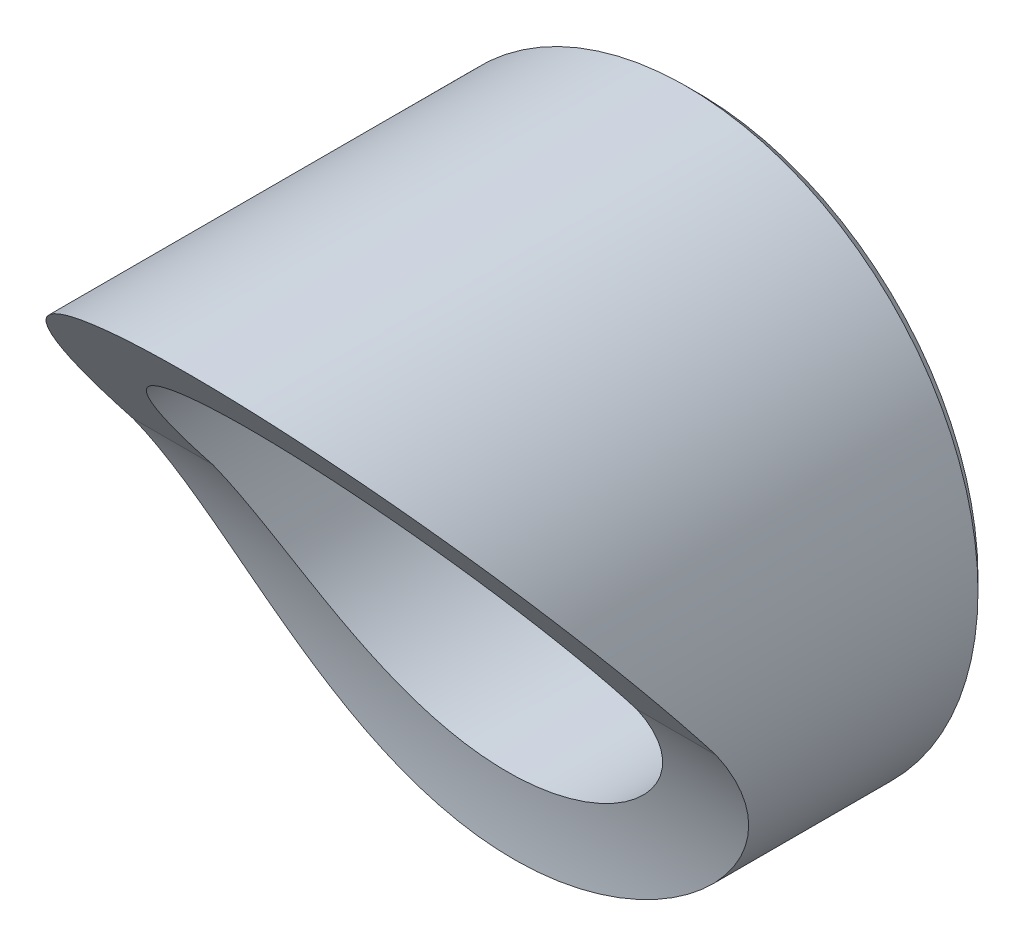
ISO-10303-21;
HEADER;
FILE_DESCRIPTION(('STEP AP214'),'2;1');
FILE_NAME('part.step','',(''),(''),'','','');
FILE_SCHEMA(('AUTOMOTIVE_DESIGN { 1 0 10303 214 1 1 1 1 }'));
ENDSEC;
DATA;
#1=APPLICATION_CONTEXT('core data for automotive mechanical design processes');
#2=APPLICATION_PROTOCOL_DEFINITION('international standard','automotive_design',2000,#1);
#3=PRODUCT_CONTEXT('',#1,'mechanical');
#4=PRODUCT('Part','Part','',(#3));
#5=PRODUCT_RELATED_PRODUCT_CATEGORY('part','',(#4));
#6=PRODUCT_DEFINITION_FORMATION('','',#4);
#7=PRODUCT_DEFINITION_CONTEXT('part definition',#1,'design');
#8=PRODUCT_DEFINITION('design','',#6,#7);
#9=PRODUCT_DEFINITION_SHAPE('','',#8);
#10=(LENGTH_UNIT() NAMED_UNIT(*) SI_UNIT(.MILLI.,.METRE.));
#11=(NAMED_UNIT(*) PLANE_ANGLE_UNIT() SI_UNIT($,.RADIAN.));
#12=(NAMED_UNIT(*) SI_UNIT($,.STERADIAN.) SOLID_ANGLE_UNIT());
#13=UNCERTAINTY_MEASURE_WITH_UNIT(LENGTH_MEASURE(1.E-05),#10,'distance_accuracy_value','');
#14=(GEOMETRIC_REPRESENTATION_CONTEXT(3) GLOBAL_UNCERTAINTY_ASSIGNED_CONTEXT((#13)) GLOBAL_UNIT_ASSIGNED_CONTEXT((#10,
#11,#12)) REPRESENTATION_CONTEXT('',''));
#15=CARTESIAN_POINT('',(0.,0.,0.));
#16=DIRECTION('',(0.,0.,1.));
#17=DIRECTION('',(1.,0.,0.));
#18=AXIS2_PLACEMENT_3D('',#15,#16,#17);
#19=CARTESIAN_POINT('',(0.,0.,0.));
#20=DIRECTION('',(0.,0.,1.));
#21=DIRECTION('',(1.,0.,0.));
#22=AXIS2_PLACEMENT_3D('',#19,#20,#21);
#23=PLANE('',#22);
#24=CARTESIAN_POINT('',(0.,0.,0.));
#25=DIRECTION('',(0.,0.,1.));
#26=DIRECTION('',(1.,0.,0.));
#27=AXIS2_PLACEMENT_3D('',#24,#25,#26);
#28=CIRCLE('',#27,11.5);
#29=CARTESIAN_POINT('',(11.5,0.,0.));
#30=VERTEX_POINT('',#29);
#31=EDGE_CURVE('E58',#30,#30,#28,.F.);
#32=ORIENTED_EDGE('',*,*,#31,.T.);
#33=EDGE_LOOP('',(#32));
#34=FACE_BOUND('',#33,.T.);
#35=CARTESIAN_POINT('',(0.,0.,0.));
#36=DIRECTION('',(0.,0.,-1.));
#37=DIRECTION('',(-1.,0.,0.));
#38=AXIS2_PLACEMENT_3D('',#35,#36,#37);
#39=CIRCLE('',#38,10.025);
#40=CARTESIAN_POINT('',(-10.025,0.,0.));
#41=VERTEX_POINT('',#40);
#42=EDGE_CURVE('E123',#41,#41,#39,.T.);
#43=ORIENTED_EDGE('',*,*,#42,.F.);
#44=EDGE_LOOP('',(#43));
#45=FACE_BOUND('',#44,.T.);
#46=ADVANCED_FACE('F49',(#34,#45),#23,.F.);
#47=CARTESIAN_POINT('',(0.,0.,21.));
#48=DIRECTION('',(0.,0.,-1.));
#49=DIRECTION('',(-1.,0.,0.));
#50=AXIS2_PLACEMENT_3D('',#47,#48,#49);
#51=CYLINDRICAL_SURFACE('',#50,12.);
#52=CARTESIAN_POINT('',(0.,0.,0.500000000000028));
#53=DIRECTION('',(0.,0.,1.));
#54=DIRECTION('',(1.,0.,0.));
#55=AXIS2_PLACEMENT_3D('',#52,#53,#54);
#56=CIRCLE('',#55,12.);
#57=CARTESIAN_POINT('',(12.,0.,0.500000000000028));
#58=VERTEX_POINT('',#57);
#59=EDGE_CURVE('E103',#58,#58,#56,.T.);
#60=ORIENTED_EDGE('',*,*,#59,.T.);
#61=EDGE_LOOP('',(#60));
#62=FACE_BOUND('',#61,.T.);
#63=CARTESIAN_POINT('',(11.9911472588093,-0.460855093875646,11.2645130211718));
#64=CARTESIAN_POINT('',(11.9860302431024,-0.593990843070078,11.1704663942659));
#65=CARTESIAN_POINT('',(11.9786509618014,-0.728210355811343,11.0780976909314));
#66=CARTESIAN_POINT('',(11.9591432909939,-0.998638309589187,10.8968104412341));
#67=CARTESIAN_POINT('',(11.9470144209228,-1.13484695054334,10.8078922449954));
#68=CARTESIAN_POINT('',(11.9031548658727,-1.54627760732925,10.5464004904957));
#69=CARTESIAN_POINT('',(11.8639556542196,-1.82417795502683,10.3791789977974));
#70=CARTESIAN_POINT('',(11.764007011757,-2.38526149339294,10.0597261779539));
#71=CARTESIAN_POINT('',(11.7032242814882,-2.66845220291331,9.90751848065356));
#72=CARTESIAN_POINT('',(11.5588575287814,-3.23710026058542,9.61908851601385));
#73=CARTESIAN_POINT('',(11.475279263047,-3.5225570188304,9.4828622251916));
#74=CARTESIAN_POINT('',(11.2839824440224,-4.09426702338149,9.22615878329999));
#75=CARTESIAN_POINT('',(11.1761511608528,-4.38051761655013,9.10575947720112));
#76=CARTESIAN_POINT('',(10.9361525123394,-4.94932837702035,8.88151982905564));
#77=CARTESIAN_POINT('',(10.8039830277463,-5.23188822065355,8.77768093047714));
#78=CARTESIAN_POINT('',(10.5156778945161,-5.78954809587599,8.58639850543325));
#79=CARTESIAN_POINT('',(10.3595858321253,-6.0646606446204,8.49892579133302));
#80=CARTESIAN_POINT('',(10.0238657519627,-6.6047869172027,8.33939304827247));
#81=CARTESIAN_POINT('',(9.84423929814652,-6.86980131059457,8.26733199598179));
#82=CARTESIAN_POINT('',(9.47512586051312,-7.36967121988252,8.1417875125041));
#83=CARTESIAN_POINT('',(9.28707712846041,-7.60536209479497,8.08739050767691));
#84=CARTESIAN_POINT('',(8.89248641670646,-8.06318823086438,7.98989299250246));
#85=CARTESIAN_POINT('',(8.6859452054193,-8.28532405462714,7.94679201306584));
#86=CARTESIAN_POINT('',(8.25551181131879,-8.7142945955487,7.87053843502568));
#87=CARTESIAN_POINT('',(8.03160557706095,-8.92111665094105,7.83739400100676));
#88=CARTESIAN_POINT('',(7.56804898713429,-9.31759979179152,7.77968529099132));
#89=CARTESIAN_POINT('',(7.32839807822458,-9.50726027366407,7.75512131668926));
#90=CARTESIAN_POINT('',(6.82854744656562,-9.87265085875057,7.71258952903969));
#91=CARTESIAN_POINT('',(6.56797722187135,-10.0478957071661,7.6948081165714));
#92=CARTESIAN_POINT('',(6.03365908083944,-10.3775482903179,7.66523016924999));
#93=CARTESIAN_POINT('',(5.75991104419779,-10.5319558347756,7.65343368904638));
#94=CARTESIAN_POINT('',(5.20103692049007,-10.8188666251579,7.63438949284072));
#95=CARTESIAN_POINT('',(4.91591138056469,-10.9513709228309,7.6271415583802));
#96=CARTESIAN_POINT('',(4.33608605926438,-11.193618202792,7.61589491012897));
#97=CARTESIAN_POINT('',(4.04138598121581,-11.3033604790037,7.61189629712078));
#98=CARTESIAN_POINT('',(3.42785389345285,-11.5047686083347,7.60586421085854));
#99=CARTESIAN_POINT('',(3.10858539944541,-11.5951108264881,7.60395071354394));
#100=CARTESIAN_POINT('',(2.46365509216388,-11.749056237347,7.60142610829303));
#101=CARTESIAN_POINT('',(2.13799306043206,-11.8126585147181,7.60081504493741));
#102=CARTESIAN_POINT('',(1.48247275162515,-11.9126913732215,7.60012787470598));
#103=CARTESIAN_POINT('',(1.15261388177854,-11.9491180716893,7.600051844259));
#104=CARTESIAN_POINT('',(0.491014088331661,-11.9945342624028,7.59998784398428));
#105=CARTESIAN_POINT('',(0.159273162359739,-12.0035237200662,7.59999987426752));
#106=CARTESIAN_POINT('',(-0.509419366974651,-11.9939225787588,7.60000020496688));
#107=CARTESIAN_POINT('',(-0.846364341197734,-11.9748635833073,7.59998810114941));
#108=CARTESIAN_POINT('',(-1.51745702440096,-11.908443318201,7.60018211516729));
#109=CARTESIAN_POINT('',(-1.85160468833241,-11.8610815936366,7.60038823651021));
#110=CARTESIAN_POINT('',(-2.5147495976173,-11.738387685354,7.60161712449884));
#111=CARTESIAN_POINT('',(-2.84374646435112,-11.663053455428,7.60263995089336));
#112=CARTESIAN_POINT('',(-3.49421986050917,-11.4849525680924,7.606434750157));
#113=CARTESIAN_POINT('',(-3.81569640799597,-11.3821859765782,7.60920671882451));
#114=CARTESIAN_POINT('',(-4.4488979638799,-11.1499350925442,7.61773571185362));
#115=CARTESIAN_POINT('',(-4.76062066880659,-11.0204445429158,7.62349343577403));
#116=CARTESIAN_POINT('',(-5.37196826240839,-10.7357187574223,7.63949119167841));
#117=CARTESIAN_POINT('',(-5.67159307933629,-10.5804833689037,7.64973125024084));
#118=CARTESIAN_POINT('',(-6.256541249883,-10.2454526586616,7.67640114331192));
#119=CARTESIAN_POINT('',(-6.54186325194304,-10.0656550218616,7.69283156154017));
#120=CARTESIAN_POINT('',(-7.09598995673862,-9.68298948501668,7.73373538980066));
#121=CARTESIAN_POINT('',(-7.36479507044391,-9.48012215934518,7.75820859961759));
#122=CARTESIAN_POINT('',(-7.87882549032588,-9.05719354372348,7.81655830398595));
#123=CARTESIAN_POINT('',(-8.12440311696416,-8.83753468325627,7.85024626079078));
#124=CARTESIAN_POINT('',(-8.59576842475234,-8.37977822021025,7.92900849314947));
#125=CARTESIAN_POINT('',(-8.82155633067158,-8.14168082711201,7.97408263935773));
#126=CARTESIAN_POINT('',(-9.25141975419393,-7.64969452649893,8.07724584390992));
#127=CARTESIAN_POINT('',(-9.45551773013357,-7.39582239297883,8.13532124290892));
#128=CARTESIAN_POINT('',(-9.84083547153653,-6.87480314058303,8.26597681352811));
#129=CARTESIAN_POINT('',(-10.0220567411,-6.60765689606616,8.33855603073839));
#130=CARTESIAN_POINT('',(-10.3507430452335,-6.07892546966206,8.49470248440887));
#131=CARTESIAN_POINT('',(-10.4995564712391,-5.81791674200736,8.57738801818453));
#132=CARTESIAN_POINT('',(-10.7754356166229,-5.28950022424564,8.75730724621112));
#133=CARTESIAN_POINT('',(-10.902501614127,-5.02209251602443,8.85454075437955));
#134=CARTESIAN_POINT('',(-11.1348974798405,-4.48332916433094,9.06400005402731));
#135=CARTESIAN_POINT('',(-11.2402019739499,-4.21196930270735,9.17624309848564));
#136=CARTESIAN_POINT('',(-11.4291791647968,-3.66833264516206,9.41562481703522));
#137=CARTESIAN_POINT('',(-11.5128541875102,-3.39605595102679,9.54276188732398));
#138=CARTESIAN_POINT('',(-11.647545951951,-2.89662876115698,9.7900759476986));
#139=CARTESIAN_POINT('',(-11.7016469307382,-2.66923547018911,9.90810613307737));
#140=CARTESIAN_POINT('',(-11.7957002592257,-2.21693634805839,10.1541424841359));
#141=CARTESIAN_POINT('',(-11.8356526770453,-1.99203050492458,10.282148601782));
#142=CARTESIAN_POINT('',(-11.9020460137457,-1.54656544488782,10.5473561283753));
#143=CARTESIAN_POINT('',(-11.9285244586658,-1.32599581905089,10.6845307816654));
#144=CARTESIAN_POINT('',(-11.9689869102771,-0.88961930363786,10.9678824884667));
#145=CARTESIAN_POINT('',(-11.9829742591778,-0.673811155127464,11.1140571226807));
#146=CARTESIAN_POINT('',(-11.9911472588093,-0.46085509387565,11.2645130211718));
#147=B_SPLINE_CURVE_WITH_KNOTS('',3,(#63,#64,#65,#66,#67,#68,#69,#70,#71,#72,#73,#74,#75,#76,
#77,#78,#79,#80,#81,#82,#83,#84,#85,#86,#87,#88,#89,#90,#91,#92,#93,#94,#95,#96,#97,#98,#99,
#100,#101,#102,#103,#104,#105,#106,#107,#108,#109,#110,#111,#112,#113,#114,#115,#116,#117,#118,
#119,#120,#121,#122,#123,#124,#125,#126,#127,#128,#129,#130,#131,#132,#133,#134,#135,#136,#137,
#138,#139,#140,#141,#142,#143,#144,#145,#146),.UNSPECIFIED.,.F.,.F.,(4,2,2,2,2,2,2,2,2,2,2,2,2,
2,2,2,2,2,2,2,2,2,2,2,2,2,2,2,2,2,2,2,2,2,2,2,2,2,2,2,2,4),(0.,0.489193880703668,
0.978437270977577,1.95738716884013,2.93785401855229,3.91807349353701,4.90294688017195,
5.88790606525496,6.87109156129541,7.85421175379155,8.77229959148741,9.69034929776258,
10.6091497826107,11.5279825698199,12.4705059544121,13.4130379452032,14.355524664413,
15.2980406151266,16.2923155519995,17.2866245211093,18.2810755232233,19.2755277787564,
20.2867765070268,21.2980414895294,22.3093804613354,23.3207170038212,24.3322906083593,
25.3438702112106,26.3555452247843,27.3671950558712,28.3595216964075,29.3518370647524,
30.3431147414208,31.3343272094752,32.2680370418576,33.2017349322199,34.1365154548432,
35.0711954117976,35.8561684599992,36.6411377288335,37.4239086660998,38.2064700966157),.UNSPECIFIED.);
#148=CARTESIAN_POINT('',(11.9911472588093,-0.460855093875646,11.2645130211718));
#149=VERTEX_POINT('',#148);
#150=CARTESIAN_POINT('',(-11.9911472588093,-0.460855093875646,11.2645130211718));
#151=VERTEX_POINT('',#150);
#152=EDGE_CURVE('E88',#149,#151,#147,.T.);
#153=ORIENTED_EDGE('',*,*,#152,.T.);
#154=CARTESIAN_POINT('',(0.,0.,11.6245724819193));
#155=DIRECTION('',(0.,0.615661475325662,-0.788010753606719));
#156=DIRECTION('',(0.,-0.788010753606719,-0.615661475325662));
#157=AXIS2_PLACEMENT_3D('',#154,#155,#156);
#158=ELLIPSE('',#157,15.228218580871,12.);
#159=EDGE_CURVE('E85',#151,#149,#158,.T.);
#160=ORIENTED_EDGE('',*,*,#159,.T.);
#161=EDGE_LOOP('',(#153,#160));
#162=FACE_BOUND('',#161,.T.);
#163=ADVANCED_FACE('F104',(#62,#162),#51,.T.);
#164=CARTESIAN_POINT('',(-50.,-12.,27.6));
#165=DIRECTION('',(1.,0.,0.));
#166=DIRECTION('',(0.,0.,-1.));
#167=AXIS2_PLACEMENT_3D('',#164,#165,#166);
#168=CYLINDRICAL_SURFACE('',#167,20.);
#169=DIRECTION('',(1.,0.,0.));
#170=VECTOR('',#169,1.);
#171=CARTESIAN_POINT('',(-50.,-0.460855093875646,11.2645130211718));
#172=LINE('',#171,#170);
#173=CARTESIAN_POINT('',(8.73785514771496,-0.460855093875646,11.2645130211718));
#174=VERTEX_POINT('',#173);
#175=EDGE_CURVE('E80',#174,#149,#172,.T.);
#176=ORIENTED_EDGE('',*,*,#175,.F.);
#177=CARTESIAN_POINT('',(8.73785514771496,-0.460855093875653,11.2645130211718));
#178=CARTESIAN_POINT('',(8.72650180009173,-0.676511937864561,11.1121253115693));
#179=CARTESIAN_POINT('',(8.70694901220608,-0.8950177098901,10.9642283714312));
#180=CARTESIAN_POINT('',(8.65022569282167,-1.33623443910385,10.6780360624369));
#181=CARTESIAN_POINT('',(8.61304082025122,-1.55894867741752,10.5397486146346));
#182=CARTESIAN_POINT('',(8.51968657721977,-2.00751351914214,10.2731820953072));
#183=CARTESIAN_POINT('',(8.46345145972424,-2.23337235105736,10.1449396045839));
#184=CARTESIAN_POINT('',(8.33109472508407,-2.68528788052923,9.89965579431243));
#185=CARTESIAN_POINT('',(8.25497851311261,-2.91134450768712,9.782611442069));
#186=CARTESIAN_POINT('',(8.08173165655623,-3.36256196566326,9.55953571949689));
#187=CARTESIAN_POINT('',(7.98448937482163,-3.58771130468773,9.45356746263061));
#188=CARTESIAN_POINT('',(7.76895304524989,-4.03325004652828,9.25359635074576));
#189=CARTESIAN_POINT('',(7.6506569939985,-4.25363899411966,9.15959463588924));
#190=CARTESIAN_POINT('',(7.39349341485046,-4.68635758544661,8.98374203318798));
#191=CARTESIAN_POINT('',(7.25467562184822,-4.89870519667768,8.90186270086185));
#192=CARTESIAN_POINT('',(6.95687453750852,-5.31314292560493,8.74967704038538));
#193=CARTESIAN_POINT('',(6.7978934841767,-5.5152341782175,8.67936942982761));
#194=CARTESIAN_POINT('',(6.47703352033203,-5.88770083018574,8.55598463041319));
#195=CARTESIAN_POINT('',(6.31690736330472,-6.05925647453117,8.50190023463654));
#196=CARTESIAN_POINT('',(5.98203287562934,-6.39008362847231,8.40211752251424));
#197=CARTESIAN_POINT('',(5.80728544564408,-6.54935589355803,8.35641869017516));
#198=CARTESIAN_POINT('',(5.44423972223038,-6.85412057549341,8.27268957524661));
#199=CARTESIAN_POINT('',(5.2559321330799,-6.99960337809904,8.23466462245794));
#200=CARTESIAN_POINT('',(4.8672235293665,-7.27525982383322,8.16557101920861));
#201=CARTESIAN_POINT('',(4.66682242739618,-7.40543335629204,8.13450241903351));
#202=CARTESIAN_POINT('',(4.25992992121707,-7.64658046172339,8.07917240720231));
#203=CARTESIAN_POINT('',(4.05366974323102,-7.75791365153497,8.05477618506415));
#204=CARTESIAN_POINT('',(3.63233875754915,-7.96389519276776,8.01120343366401));
#205=CARTESIAN_POINT('',(3.41726412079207,-8.05853619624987,7.99202920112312));
#206=CARTESIAN_POINT('',(2.97992773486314,-8.23029237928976,7.95828500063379));
#207=CARTESIAN_POINT('',(2.75766736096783,-8.30741089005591,7.9437141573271));
#208=CARTESIAN_POINT('',(2.30754574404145,-8.44351792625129,7.91863254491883));
#209=CARTESIAN_POINT('',(2.07968691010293,-8.50251410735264,7.90812006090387));
#210=CARTESIAN_POINT('',(1.61526975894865,-8.60296211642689,7.8905405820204));
#211=CARTESIAN_POINT('',(1.37862852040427,-8.6440435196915,7.88354591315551));
#212=CARTESIAN_POINT('',(0.902694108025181,-8.70662122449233,7.87299657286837));
#213=CARTESIAN_POINT('',(0.663400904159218,-8.72811730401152,7.86944194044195));
#214=CARTESIAN_POINT('',(0.183797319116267,-8.75136367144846,7.86560105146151));
#215=CARTESIAN_POINT('',(-0.0565131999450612,-8.75311119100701,7.86531525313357));
#216=CARTESIAN_POINT('',(-0.53644632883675,-8.73684018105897,7.86799921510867));
#217=CARTESIAN_POINT('',(-0.776068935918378,-8.71882157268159,7.87096898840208));
#218=CARTESIAN_POINT('',(-1.2554056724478,-8.66286755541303,7.88035598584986));
#219=CARTESIAN_POINT('',(-1.49509551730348,-8.62472970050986,7.88680826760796));
#220=CARTESIAN_POINT('',(-1.97035767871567,-8.52871409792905,7.9034890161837));
#221=CARTESIAN_POINT('',(-2.20592995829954,-8.47083617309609,7.91371751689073));
#222=CARTESIAN_POINT('',(-2.67125431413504,-8.33580161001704,7.93840401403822));
#223=CARTESIAN_POINT('',(-2.90100647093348,-8.25864523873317,7.95286195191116));
#224=CARTESIAN_POINT('',(-3.35301819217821,-8.0856863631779,7.98658862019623));
#225=CARTESIAN_POINT('',(-3.57527781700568,-7.98988400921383,8.00585731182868));
#226=CARTESIAN_POINT('',(-4.0096481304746,-7.78094030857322,8.04978590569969));
#227=CARTESIAN_POINT('',(-4.22180146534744,-7.66788224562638,8.07442014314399));
#228=CARTESIAN_POINT('',(-4.63550316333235,-7.42510137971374,8.1298742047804));
#229=CARTESIAN_POINT('',(-4.83705155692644,-7.29537862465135,8.16069401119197));
#230=CARTESIAN_POINT('',(-5.22802468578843,-7.02049509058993,8.22928539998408));
#231=CARTESIAN_POINT('',(-5.41745159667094,-6.87533709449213,8.2670557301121));
#232=CARTESIAN_POINT('',(-5.78284700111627,-6.57097508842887,8.35030991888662));
#233=CARTESIAN_POINT('',(-5.95881576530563,-6.41177136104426,8.39579362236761));
#234=CARTESIAN_POINT('',(-6.29287229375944,-6.08407433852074,8.49422797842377));
#235=CARTESIAN_POINT('',(-6.45123618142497,-5.91581489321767,8.54702041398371));
#236=CARTESIAN_POINT('',(-6.75287178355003,-5.56902436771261,8.66126007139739));
#237=CARTESIAN_POINT('',(-6.89614371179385,-5.39049343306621,8.72270717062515));
#238=CARTESIAN_POINT('',(-7.16681848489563,-5.02502836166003,8.85466729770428));
#239=CARTESIAN_POINT('',(-7.29422498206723,-4.83809617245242,8.92517823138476));
#240=CARTESIAN_POINT('',(-7.53271425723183,-4.45770249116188,9.07554135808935));
#241=CARTESIAN_POINT('',(-7.64379725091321,-4.26424108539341,9.15539342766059));
#242=CARTESIAN_POINT('',(-7.84907404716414,-3.87338384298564,9.32424358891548));
#243=CARTESIAN_POINT('',(-7.94332385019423,-3.67600357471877,9.41320974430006));
#244=CARTESIAN_POINT('',(-8.11545667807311,-3.27853220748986,9.60043717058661));
#245=CARTESIAN_POINT('',(-8.19333871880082,-3.07844094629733,9.69869899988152));
#246=CARTESIAN_POINT('',(-8.33306158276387,-2.67725997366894,9.90431305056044));
#247=CARTESIAN_POINT('',(-8.39489721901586,-2.47616996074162,10.0116681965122));
#248=CARTESIAN_POINT('',(-8.50301691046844,-2.07470886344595,10.2350531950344));
#249=CARTESIAN_POINT('',(-8.5493043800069,-1.87433763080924,10.3510811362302));
#250=CARTESIAN_POINT('',(-8.62831042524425,-1.46925209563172,10.5952655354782));
#251=CARTESIAN_POINT('',(-8.66054177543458,-1.26460689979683,10.7236928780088));
#252=CARTESIAN_POINT('',(-8.71007420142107,-0.859469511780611,10.9883396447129));
#253=CARTESIAN_POINT('',(-8.72742089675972,-0.658966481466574,11.1245338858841));
#254=CARTESIAN_POINT('',(-8.73785514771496,-0.460855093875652,11.2645130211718));
#255=B_SPLINE_CURVE_WITH_KNOTS('',3,(#177,#178,#179,#180,#181,#182,#183,#184,#185,#186,#187,
#188,#189,#190,#191,#192,#193,#194,#195,#196,#197,#198,#199,#200,#201,#202,#203,#204,#205,#206,
#207,#208,#209,#210,#211,#212,#213,#214,#215,#216,#217,#218,#219,#220,#221,#222,#223,#224,#225,
#226,#227,#228,#229,#230,#231,#232,#233,#234,#235,#236,#237,#238,#239,#240,#241,#242,#243,#244,
#245,#246,#247,#248,#249,#250,#251,#252,#253,#254),.UNSPECIFIED.,.F.,.F.,(4,2,2,2,2,2,2,2,2,2,2,
2,2,2,2,2,2,2,2,2,2,2,2,2,2,2,2,2,2,2,2,2,2,2,2,2,2,2,4),(0.,0.792876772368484,1.58639954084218,
2.38268933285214,3.17876285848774,3.97915011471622,4.77961357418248,5.5781679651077,
6.37663379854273,7.09822288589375,7.81976755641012,8.54181165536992,9.26386097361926,
9.97001332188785,10.6764757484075,11.3828037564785,12.0888329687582,12.8088386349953,
13.528852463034,14.2489672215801,14.9690848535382,15.6965907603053,16.4241031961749,
17.1516055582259,17.879102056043,18.6031923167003,19.3272804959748,20.0512383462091,
20.7751816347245,21.4853758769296,22.1955600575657,22.9055804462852,23.6155914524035,
24.3231945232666,25.0308401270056,25.7387141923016,26.4464327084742,27.1770386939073,
27.9053973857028),.UNSPECIFIED.);
#256=CARTESIAN_POINT('',(-8.73785514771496,-0.460855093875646,11.2645130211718));
#257=VERTEX_POINT('',#256);
#258=EDGE_CURVE('E64',#174,#257,#255,.T.);
#259=ORIENTED_EDGE('',*,*,#258,.T.);
#260=EDGE_CURVE('E70',#151,#257,#172,.T.);
#261=ORIENTED_EDGE('',*,*,#260,.F.);
#262=ORIENTED_EDGE('',*,*,#152,.F.);
#263=EDGE_LOOP('',(#176,#259,#261,#262));
#264=FACE_BOUND('',#263,.T.);
#265=ADVANCED_FACE('F79',(#264),#168,.F.);
#266=CARTESIAN_POINT('',(-50.,12.,21.));
#267=DIRECTION('',(0.,0.615661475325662,-0.788010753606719));
#268=DIRECTION('',(0.,0.788010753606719,0.615661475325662));
#269=AXIS2_PLACEMENT_3D('',#266,#267,#268);
#270=PLANE('',#269);
#271=ORIENTED_EDGE('',*,*,#260,.T.);
#272=CARTESIAN_POINT('',(0.,0.,11.6245724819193));
#273=DIRECTION('',(0.,0.615661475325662,-0.788010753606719));
#274=DIRECTION('',(0.,-0.788010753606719,-0.615661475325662));
#275=AXIS2_PLACEMENT_3D('',#272,#273,#274);
#276=ELLIPSE('',#275,11.1039093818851,8.75);
#277=EDGE_CURVE('E11',#257,#174,#276,.T.);
#278=ORIENTED_EDGE('',*,*,#277,.T.);
#279=ORIENTED_EDGE('',*,*,#175,.T.);
#280=ORIENTED_EDGE('',*,*,#159,.F.);
#281=EDGE_LOOP('',(#271,#278,#279,#280));
#282=FACE_BOUND('',#281,.T.);
#283=ADVANCED_FACE('F83',(#282),#270,.F.);
#284=CARTESIAN_POINT('',(0.,0.,0.500000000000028));
#285=DIRECTION('',(0.,0.,1.));
#286=DIRECTION('',(1.,0.,0.));
#287=AXIS2_PLACEMENT_3D('',#284,#285,#286);
#288=CONICAL_SURFACE('',#287,12.,0.785398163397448);
#289=ORIENTED_EDGE('',*,*,#31,.F.);
#290=EDGE_LOOP('',(#289));
#291=FACE_BOUND('',#290,.T.);
#292=ORIENTED_EDGE('',*,*,#59,.F.);
#293=EDGE_LOOP('',(#292));
#294=FACE_BOUND('',#293,.T.);
#295=ADVANCED_FACE('F52',(#291,#294),#288,.T.);
#296=CARTESIAN_POINT('',(0.,0.,0.));
#297=DIRECTION('',(0.,0.,-1.));
#298=DIRECTION('',(-1.,0.,0.));
#299=AXIS2_PLACEMENT_3D('',#296,#297,#298);
#300=CYLINDRICAL_SURFACE('',#299,8.75);
#301=CARTESIAN_POINT('',(0.,0.,1.275));
#302=DIRECTION('',(0.,0.,-1.));
#303=DIRECTION('',(-1.,0.,0.));
#304=AXIS2_PLACEMENT_3D('',#301,#302,#303);
#305=CIRCLE('',#304,8.75);
#306=CARTESIAN_POINT('',(-8.75,0.,1.275));
#307=VERTEX_POINT('',#306);
#308=EDGE_CURVE('E81',#307,#307,#305,.T.);
#309=ORIENTED_EDGE('',*,*,#308,.T.);
#310=EDGE_LOOP('',(#309));
#311=FACE_BOUND('',#310,.T.);
#312=ORIENTED_EDGE('',*,*,#277,.F.);
#313=ORIENTED_EDGE('',*,*,#258,.F.);
#314=EDGE_LOOP('',(#312,#313));
#315=FACE_BOUND('',#314,.T.);
#316=ADVANCED_FACE('F76',(#311,#315),#300,.F.);
#317=CARTESIAN_POINT('',(0.,0.,0.));
#318=DIRECTION('',(0.,0.,-1.));
#319=DIRECTION('',(-1.,0.,0.));
#320=AXIS2_PLACEMENT_3D('',#317,#318,#319);
#321=CONICAL_SURFACE('',#320,10.025,0.785398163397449);
#322=ORIENTED_EDGE('',*,*,#308,.F.);
#323=EDGE_LOOP('',(#322));
#324=FACE_BOUND('',#323,.T.);
#325=ORIENTED_EDGE('',*,*,#42,.T.);
#326=EDGE_LOOP('',(#325));
#327=FACE_BOUND('',#326,.T.);
#328=ADVANCED_FACE('F130',(#324,#327),#321,.F.);
#329=CLOSED_SHELL('',(#46,#163,#265,#283,#295,#316,#328));
#330=MANIFOLD_SOLID_BREP('B2',#329);
#331=ADVANCED_BREP_SHAPE_REPRESENTATION('',(#18,#330),#14);
#332=SHAPE_DEFINITION_REPRESENTATION(#9,#331);
ENDSEC;
END-ISO-10303-21;
